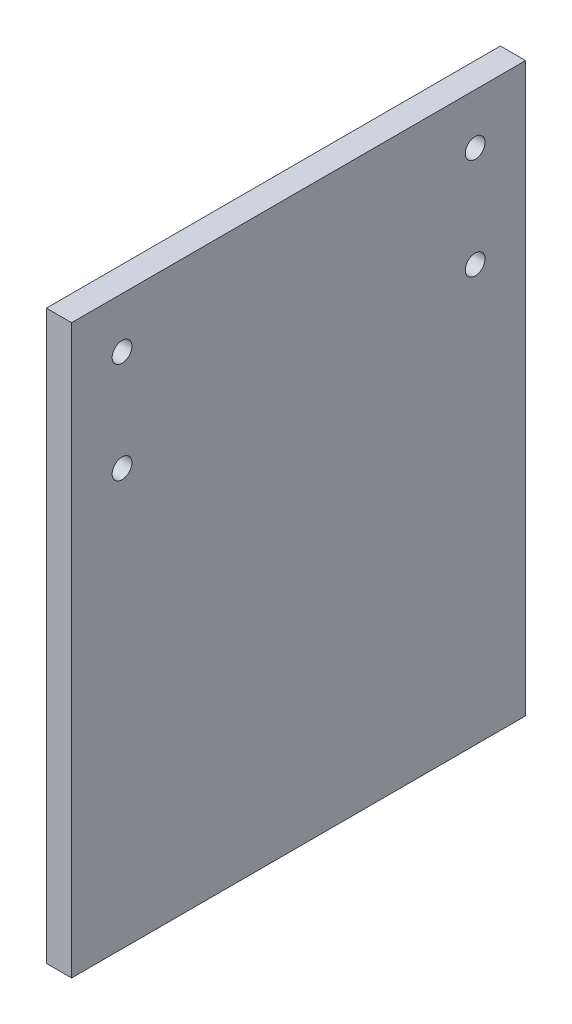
ISO-10303-21;
HEADER;
FILE_DESCRIPTION(('STEP AP214'),'2;1');
FILE_NAME('part.step','',(''),(''),'','','');
FILE_SCHEMA(('AUTOMOTIVE_DESIGN { 1 0 10303 214 1 1 1 1 }'));
ENDSEC;
DATA;
#1=APPLICATION_CONTEXT('core data for automotive mechanical design processes');
#2=APPLICATION_PROTOCOL_DEFINITION('international standard','automotive_design',2000,#1);
#3=PRODUCT_CONTEXT('',#1,'mechanical');
#4=PRODUCT('Part','Part','',(#3));
#5=PRODUCT_RELATED_PRODUCT_CATEGORY('part','',(#4));
#6=PRODUCT_DEFINITION_FORMATION('','',#4);
#7=PRODUCT_DEFINITION_CONTEXT('part definition',#1,'design');
#8=PRODUCT_DEFINITION('design','',#6,#7);
#9=PRODUCT_DEFINITION_SHAPE('','',#8);
#10=(LENGTH_UNIT() NAMED_UNIT(*) SI_UNIT(.MILLI.,.METRE.));
#11=(NAMED_UNIT(*) PLANE_ANGLE_UNIT() SI_UNIT($,.RADIAN.));
#12=(NAMED_UNIT(*) SI_UNIT($,.STERADIAN.) SOLID_ANGLE_UNIT());
#13=UNCERTAINTY_MEASURE_WITH_UNIT(LENGTH_MEASURE(1.E-05),#10,'distance_accuracy_value','');
#14=(GEOMETRIC_REPRESENTATION_CONTEXT(3) GLOBAL_UNCERTAINTY_ASSIGNED_CONTEXT((#13)) GLOBAL_UNIT_ASSIGNED_CONTEXT((#10,
#11,#12)) REPRESENTATION_CONTEXT('',''));
#15=CARTESIAN_POINT('',(0.,0.,0.));
#16=DIRECTION('',(0.,0.,1.));
#17=DIRECTION('',(1.,0.,0.));
#18=AXIS2_PLACEMENT_3D('',#15,#16,#17);
#19=CARTESIAN_POINT('',(3.175,71.4375,-57.15));
#20=DIRECTION('',(0.,0.,1.));
#21=DIRECTION('',(0.,-1.,0.));
#22=AXIS2_PLACEMENT_3D('',#19,#20,#21);
#23=PLANE('',#22);
#24=DIRECTION('',(0.,1.,0.));
#25=VECTOR('',#24,1.);
#26=CARTESIAN_POINT('',(-3.175,71.4375,-57.15));
#27=LINE('',#26,#25);
#28=CARTESIAN_POINT('',(-3.175,-71.4375,-57.15));
#29=VERTEX_POINT('',#28);
#30=CARTESIAN_POINT('',(-3.175,71.4375,-57.15));
#31=VERTEX_POINT('',#30);
#32=EDGE_CURVE('E103',#29,#31,#27,.T.);
#33=ORIENTED_EDGE('',*,*,#32,.T.);
#34=DIRECTION('',(-1.,0.,0.));
#35=VECTOR('',#34,1.);
#36=CARTESIAN_POINT('',(3.175,71.4375,-57.15));
#37=LINE('',#36,#35);
#38=CARTESIAN_POINT('',(3.175,71.4375,-57.15));
#39=VERTEX_POINT('',#38);
#40=EDGE_CURVE('E11',#39,#31,#37,.T.);
#41=ORIENTED_EDGE('',*,*,#40,.F.);
#42=DIRECTION('',(0.,1.,0.));
#43=VECTOR('',#42,1.);
#44=CARTESIAN_POINT('',(3.175,71.4375,-57.15));
#45=LINE('',#44,#43);
#46=CARTESIAN_POINT('',(3.175,-71.4375,-57.15));
#47=VERTEX_POINT('',#46);
#48=EDGE_CURVE('E91',#47,#39,#45,.T.);
#49=ORIENTED_EDGE('',*,*,#48,.F.);
#50=DIRECTION('',(-1.,0.,0.));
#51=VECTOR('',#50,1.);
#52=CARTESIAN_POINT('',(3.175,-71.4375,-57.15));
#53=LINE('',#52,#51);
#54=EDGE_CURVE('E99',#47,#29,#53,.T.);
#55=ORIENTED_EDGE('',*,*,#54,.T.);
#56=EDGE_LOOP('',(#33,#41,#49,#55));
#57=FACE_BOUND('',#56,.T.);
#58=ADVANCED_FACE('F40',(#57),#23,.F.);
#59=CARTESIAN_POINT('',(3.175,71.4375,57.15));
#60=DIRECTION('',(0.,-1.,0.));
#61=DIRECTION('',(0.,0.,-1.));
#62=AXIS2_PLACEMENT_3D('',#59,#60,#61);
#63=PLANE('',#62);
#64=DIRECTION('',(0.,0.,1.));
#65=VECTOR('',#64,1.);
#66=CARTESIAN_POINT('',(-3.175,71.4375,57.15));
#67=LINE('',#66,#65);
#68=CARTESIAN_POINT('',(-3.175,71.4375,57.15));
#69=VERTEX_POINT('',#68);
#70=EDGE_CURVE('E95',#31,#69,#67,.T.);
#71=ORIENTED_EDGE('',*,*,#70,.T.);
#72=DIRECTION('',(-1.,0.,0.));
#73=VECTOR('',#72,1.);
#74=CARTESIAN_POINT('',(3.175,71.4375,57.15));
#75=LINE('',#74,#73);
#76=CARTESIAN_POINT('',(3.175,71.4375,57.15));
#77=VERTEX_POINT('',#76);
#78=EDGE_CURVE('E48',#77,#69,#75,.T.);
#79=ORIENTED_EDGE('',*,*,#78,.F.);
#80=DIRECTION('',(0.,0.,1.));
#81=VECTOR('',#80,1.);
#82=CARTESIAN_POINT('',(3.175,71.4375,57.15));
#83=LINE('',#82,#81);
#84=EDGE_CURVE('E86',#39,#77,#83,.T.);
#85=ORIENTED_EDGE('',*,*,#84,.F.);
#86=ORIENTED_EDGE('',*,*,#40,.T.);
#87=EDGE_LOOP('',(#71,#79,#85,#86));
#88=FACE_BOUND('',#87,.T.);
#89=ADVANCED_FACE('F94',(#88),#63,.F.);
#90=CARTESIAN_POINT('',(3.175,71.4375,57.15));
#91=DIRECTION('',(0.,0.,-1.));
#92=DIRECTION('',(0.,1.,0.));
#93=AXIS2_PLACEMENT_3D('',#90,#91,#92);
#94=PLANE('',#93);
#95=DIRECTION('',(0.,-1.,0.));
#96=VECTOR('',#95,1.);
#97=CARTESIAN_POINT('',(-3.175,71.4375,57.15));
#98=LINE('',#97,#96);
#99=CARTESIAN_POINT('',(-3.175,-71.4375,57.15));
#100=VERTEX_POINT('',#99);
#101=EDGE_CURVE('E73',#69,#100,#98,.T.);
#102=ORIENTED_EDGE('',*,*,#101,.T.);
#103=DIRECTION('',(-1.,0.,0.));
#104=VECTOR('',#103,1.);
#105=CARTESIAN_POINT('',(3.175,-71.4375,57.15));
#106=LINE('',#105,#104);
#107=CARTESIAN_POINT('',(3.175,-71.4375,57.15));
#108=VERTEX_POINT('',#107);
#109=EDGE_CURVE('E96',#108,#100,#106,.T.);
#110=ORIENTED_EDGE('',*,*,#109,.F.);
#111=DIRECTION('',(0.,-1.,0.));
#112=VECTOR('',#111,1.);
#113=CARTESIAN_POINT('',(3.175,71.4375,57.15));
#114=LINE('',#113,#112);
#115=EDGE_CURVE('E89',#77,#108,#114,.T.);
#116=ORIENTED_EDGE('',*,*,#115,.F.);
#117=ORIENTED_EDGE('',*,*,#78,.T.);
#118=EDGE_LOOP('',(#102,#110,#116,#117));
#119=FACE_BOUND('',#118,.T.);
#120=ADVANCED_FACE('F97',(#119),#94,.F.);
#121=CARTESIAN_POINT('',(3.175,-71.4375,57.15));
#122=DIRECTION('',(0.,1.,0.));
#123=DIRECTION('',(0.,0.,1.));
#124=AXIS2_PLACEMENT_3D('',#121,#122,#123);
#125=PLANE('',#124);
#126=DIRECTION('',(0.,0.,-1.));
#127=VECTOR('',#126,1.);
#128=CARTESIAN_POINT('',(-3.175,-71.4375,57.15));
#129=LINE('',#128,#127);
#130=EDGE_CURVE('E79',#100,#29,#129,.T.);
#131=ORIENTED_EDGE('',*,*,#130,.T.);
#132=ORIENTED_EDGE('',*,*,#54,.F.);
#133=DIRECTION('',(0.,0.,-1.));
#134=VECTOR('',#133,1.);
#135=CARTESIAN_POINT('',(3.175,-71.4375,57.15));
#136=LINE('',#135,#134);
#137=EDGE_CURVE('E56',#108,#47,#136,.T.);
#138=ORIENTED_EDGE('',*,*,#137,.F.);
#139=ORIENTED_EDGE('',*,*,#109,.T.);
#140=EDGE_LOOP('',(#131,#132,#138,#139));
#141=FACE_BOUND('',#140,.T.);
#142=ADVANCED_FACE('F112',(#141),#125,.F.);
#143=CARTESIAN_POINT('',(3.175,0.,0.));
#144=DIRECTION('',(1.,0.,0.));
#145=DIRECTION('',(0.,0.,-1.));
#146=AXIS2_PLACEMENT_3D('',#143,#144,#145);
#147=PLANE('',#146);
#148=CARTESIAN_POINT('',(3.175,58.7375,-44.45));
#149=DIRECTION('',(1.,0.,0.));
#150=DIRECTION('',(0.,0.,-1.));
#151=AXIS2_PLACEMENT_3D('',#148,#149,#150);
#152=CIRCLE('',#151,2.4892);
#153=CARTESIAN_POINT('',(3.175,58.7375,-46.9392));
#154=VERTEX_POINT('',#153);
#155=EDGE_CURVE('E139',#154,#154,#152,.T.);
#156=ORIENTED_EDGE('',*,*,#155,.F.);
#157=EDGE_LOOP('',(#156));
#158=FACE_BOUND('',#157,.T.);
#159=CARTESIAN_POINT('',(3.175,58.7375,44.45));
#160=DIRECTION('',(1.,0.,0.));
#161=DIRECTION('',(0.,0.,-1.));
#162=AXIS2_PLACEMENT_3D('',#159,#160,#161);
#163=CIRCLE('',#162,2.4892);
#164=CARTESIAN_POINT('',(3.175,58.7375,41.9608));
#165=VERTEX_POINT('',#164);
#166=EDGE_CURVE('E133',#165,#165,#163,.T.);
#167=ORIENTED_EDGE('',*,*,#166,.F.);
#168=EDGE_LOOP('',(#167));
#169=FACE_BOUND('',#168,.T.);
#170=CARTESIAN_POINT('',(3.175,33.3375,44.45));
#171=DIRECTION('',(1.,0.,0.));
#172=DIRECTION('',(0.,0.,-1.));
#173=AXIS2_PLACEMENT_3D('',#170,#171,#172);
#174=CIRCLE('',#173,2.4892);
#175=CARTESIAN_POINT('',(3.175,33.3375,41.9608));
#176=VERTEX_POINT('',#175);
#177=EDGE_CURVE('E127',#176,#176,#174,.T.);
#178=ORIENTED_EDGE('',*,*,#177,.F.);
#179=EDGE_LOOP('',(#178));
#180=FACE_BOUND('',#179,.T.);
#181=CARTESIAN_POINT('',(3.175,33.3375,-44.45));
#182=DIRECTION('',(1.,0.,0.));
#183=DIRECTION('',(0.,0.,-1.));
#184=AXIS2_PLACEMENT_3D('',#181,#182,#183);
#185=CIRCLE('',#184,2.4892);
#186=CARTESIAN_POINT('',(3.175,33.3375,-46.9392));
#187=VERTEX_POINT('',#186);
#188=EDGE_CURVE('E121',#187,#187,#185,.T.);
#189=ORIENTED_EDGE('',*,*,#188,.F.);
#190=EDGE_LOOP('',(#189));
#191=FACE_BOUND('',#190,.T.);
#192=ORIENTED_EDGE('',*,*,#48,.T.);
#193=ORIENTED_EDGE('',*,*,#84,.T.);
#194=ORIENTED_EDGE('',*,*,#115,.T.);
#195=ORIENTED_EDGE('',*,*,#137,.T.);
#196=EDGE_LOOP('',(#192,#193,#194,#195));
#197=FACE_BOUND('',#196,.T.);
#198=ADVANCED_FACE('F87',(#158,#169,#180,#191,#197),#147,.T.);
#199=CARTESIAN_POINT('',(-3.175,0.,0.));
#200=DIRECTION('',(1.,0.,0.));
#201=DIRECTION('',(0.,0.,-1.));
#202=AXIS2_PLACEMENT_3D('',#199,#200,#201);
#203=PLANE('',#202);
#204=CARTESIAN_POINT('',(-3.175,58.7375,-44.45));
#205=DIRECTION('',(1.,0.,0.));
#206=DIRECTION('',(0.,0.,-1.));
#207=AXIS2_PLACEMENT_3D('',#204,#205,#206);
#208=CIRCLE('',#207,2.4892);
#209=CARTESIAN_POINT('',(-3.175,58.7375,-46.9392));
#210=VERTEX_POINT('',#209);
#211=EDGE_CURVE('E136',#210,#210,#208,.T.);
#212=ORIENTED_EDGE('',*,*,#211,.T.);
#213=EDGE_LOOP('',(#212));
#214=FACE_BOUND('',#213,.T.);
#215=CARTESIAN_POINT('',(-3.175,58.7375,44.45));
#216=DIRECTION('',(1.,0.,0.));
#217=DIRECTION('',(0.,0.,-1.));
#218=AXIS2_PLACEMENT_3D('',#215,#216,#217);
#219=CIRCLE('',#218,2.4892);
#220=CARTESIAN_POINT('',(-3.175,58.7375,41.9608));
#221=VERTEX_POINT('',#220);
#222=EDGE_CURVE('E130',#221,#221,#219,.T.);
#223=ORIENTED_EDGE('',*,*,#222,.T.);
#224=EDGE_LOOP('',(#223));
#225=FACE_BOUND('',#224,.T.);
#226=CARTESIAN_POINT('',(-3.175,33.3375,44.45));
#227=DIRECTION('',(1.,0.,0.));
#228=DIRECTION('',(0.,0.,-1.));
#229=AXIS2_PLACEMENT_3D('',#226,#227,#228);
#230=CIRCLE('',#229,2.4892);
#231=CARTESIAN_POINT('',(-3.175,33.3375,41.9608));
#232=VERTEX_POINT('',#231);
#233=EDGE_CURVE('E124',#232,#232,#230,.T.);
#234=ORIENTED_EDGE('',*,*,#233,.T.);
#235=EDGE_LOOP('',(#234));
#236=FACE_BOUND('',#235,.T.);
#237=CARTESIAN_POINT('',(-3.175,33.3375,-44.45));
#238=DIRECTION('',(1.,0.,0.));
#239=DIRECTION('',(0.,0.,-1.));
#240=AXIS2_PLACEMENT_3D('',#237,#238,#239);
#241=CIRCLE('',#240,2.4892);
#242=CARTESIAN_POINT('',(-3.175,33.3375,-46.9392));
#243=VERTEX_POINT('',#242);
#244=EDGE_CURVE('E107',#243,#243,#241,.T.);
#245=ORIENTED_EDGE('',*,*,#244,.T.);
#246=EDGE_LOOP('',(#245));
#247=FACE_BOUND('',#246,.T.);
#248=ORIENTED_EDGE('',*,*,#32,.F.);
#249=ORIENTED_EDGE('',*,*,#130,.F.);
#250=ORIENTED_EDGE('',*,*,#101,.F.);
#251=ORIENTED_EDGE('',*,*,#70,.F.);
#252=EDGE_LOOP('',(#248,#249,#250,#251));
#253=FACE_BOUND('',#252,.T.);
#254=ADVANCED_FACE('F115',(#214,#225,#236,#247,#253),#203,.F.);
#255=CARTESIAN_POINT('',(3.175,33.3375,-44.45));
#256=DIRECTION('',(1.,0.,0.));
#257=DIRECTION('',(0.,0.,-1.));
#258=AXIS2_PLACEMENT_3D('',#255,#256,#257);
#259=CYLINDRICAL_SURFACE('',#258,2.4892);
#260=ORIENTED_EDGE('',*,*,#244,.F.);
#261=EDGE_LOOP('',(#260));
#262=FACE_BOUND('',#261,.T.);
#263=ORIENTED_EDGE('',*,*,#188,.T.);
#264=EDGE_LOOP('',(#263));
#265=FACE_BOUND('',#264,.T.);
#266=ADVANCED_FACE('F154',(#262,#265),#259,.F.);
#267=CARTESIAN_POINT('',(3.175,33.3375,44.45));
#268=DIRECTION('',(1.,0.,0.));
#269=DIRECTION('',(0.,0.,-1.));
#270=AXIS2_PLACEMENT_3D('',#267,#268,#269);
#271=CYLINDRICAL_SURFACE('',#270,2.4892);
#272=ORIENTED_EDGE('',*,*,#233,.F.);
#273=EDGE_LOOP('',(#272));
#274=FACE_BOUND('',#273,.T.);
#275=ORIENTED_EDGE('',*,*,#177,.T.);
#276=EDGE_LOOP('',(#275));
#277=FACE_BOUND('',#276,.T.);
#278=ADVANCED_FACE('F156',(#274,#277),#271,.F.);
#279=CARTESIAN_POINT('',(3.175,58.7375,44.45));
#280=DIRECTION('',(1.,0.,0.));
#281=DIRECTION('',(0.,0.,-1.));
#282=AXIS2_PLACEMENT_3D('',#279,#280,#281);
#283=CYLINDRICAL_SURFACE('',#282,2.4892);
#284=ORIENTED_EDGE('',*,*,#222,.F.);
#285=EDGE_LOOP('',(#284));
#286=FACE_BOUND('',#285,.T.);
#287=ORIENTED_EDGE('',*,*,#166,.T.);
#288=EDGE_LOOP('',(#287));
#289=FACE_BOUND('',#288,.T.);
#290=ADVANCED_FACE('F163',(#286,#289),#283,.F.);
#291=CARTESIAN_POINT('',(3.175,58.7375,-44.45));
#292=DIRECTION('',(1.,0.,0.));
#293=DIRECTION('',(0.,0.,-1.));
#294=AXIS2_PLACEMENT_3D('',#291,#292,#293);
#295=CYLINDRICAL_SURFACE('',#294,2.4892);
#296=ORIENTED_EDGE('',*,*,#211,.F.);
#297=EDGE_LOOP('',(#296));
#298=FACE_BOUND('',#297,.T.);
#299=ORIENTED_EDGE('',*,*,#155,.T.);
#300=EDGE_LOOP('',(#299));
#301=FACE_BOUND('',#300,.T.);
#302=ADVANCED_FACE('F143',(#298,#301),#295,.F.);
#303=CLOSED_SHELL('',(#58,#89,#120,#142,#198,#254,#266,#278,#290,#302));
#304=MANIFOLD_SOLID_BREP('B2',#303);
#305=ADVANCED_BREP_SHAPE_REPRESENTATION('',(#18,#304),#14);
#306=SHAPE_DEFINITION_REPRESENTATION(#9,#305);
ENDSEC;
END-ISO-10303-21;
